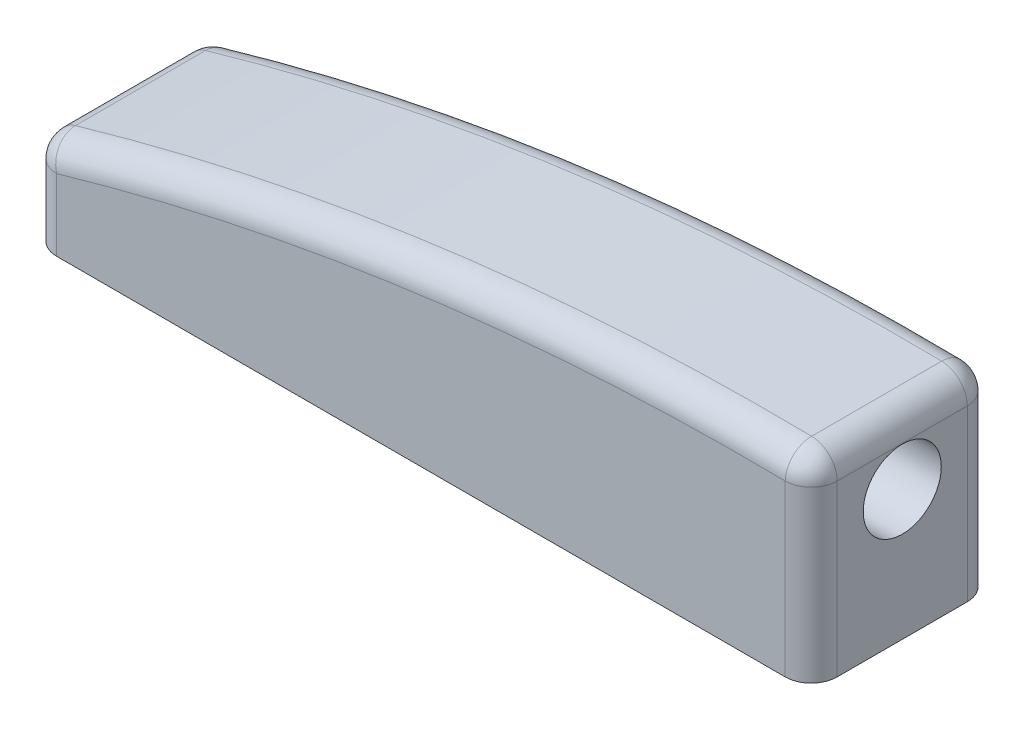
ISO-10303-21;
HEADER;
FILE_DESCRIPTION(('STEP AP214'),'2;1');
FILE_NAME('part.step','',(''),(''),'','','');
FILE_SCHEMA(('AUTOMOTIVE_DESIGN { 1 0 10303 214 1 1 1 1 }'));
ENDSEC;
DATA;
#1=APPLICATION_CONTEXT('core data for automotive mechanical design processes');
#2=APPLICATION_PROTOCOL_DEFINITION('international standard','automotive_design',2000,#1);
#3=PRODUCT_CONTEXT('',#1,'mechanical');
#4=PRODUCT('Part','Part','',(#3));
#5=PRODUCT_RELATED_PRODUCT_CATEGORY('part','',(#4));
#6=PRODUCT_DEFINITION_FORMATION('','',#4);
#7=PRODUCT_DEFINITION_CONTEXT('part definition',#1,'design');
#8=PRODUCT_DEFINITION('design','',#6,#7);
#9=PRODUCT_DEFINITION_SHAPE('','',#8);
#10=(LENGTH_UNIT() NAMED_UNIT(*) SI_UNIT(.MILLI.,.METRE.));
#11=(NAMED_UNIT(*) PLANE_ANGLE_UNIT() SI_UNIT($,.RADIAN.));
#12=(NAMED_UNIT(*) SI_UNIT($,.STERADIAN.) SOLID_ANGLE_UNIT());
#13=UNCERTAINTY_MEASURE_WITH_UNIT(LENGTH_MEASURE(1.E-05),#10,'distance_accuracy_value','');
#14=(GEOMETRIC_REPRESENTATION_CONTEXT(3) GLOBAL_UNCERTAINTY_ASSIGNED_CONTEXT((#13)) GLOBAL_UNIT_ASSIGNED_CONTEXT((#10,
#11,#12)) REPRESENTATION_CONTEXT('',''));
#15=CARTESIAN_POINT('',(0.,0.,0.));
#16=DIRECTION('',(0.,0.,1.));
#17=DIRECTION('',(1.,0.,0.));
#18=AXIS2_PLACEMENT_3D('',#15,#16,#17);
#19=CARTESIAN_POINT('',(-68.2676375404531,0.,35.));
#20=DIRECTION('',(0.,1.,0.));
#21=DIRECTION('',(0.,0.,1.));
#22=AXIS2_PLACEMENT_3D('',#19,#20,#21);
#23=PLANE('',#22);
#24=DIRECTION('',(0.,0.,-1.));
#25=VECTOR('',#24,1.);
#26=CARTESIAN_POINT('',(-68.2676375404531,0.,35.));
#27=LINE('',#26,#25);
#28=CARTESIAN_POINT('',(-68.2676375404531,0.,25.));
#29=VERTEX_POINT('',#28);
#30=CARTESIAN_POINT('',(-68.2676375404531,0.,-25.));
#31=VERTEX_POINT('',#30);
#32=EDGE_CURVE('E407',#29,#31,#27,.T.);
#33=ORIENTED_EDGE('',*,*,#32,.T.);
#34=CARTESIAN_POINT('',(-58.2676375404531,0.,-25.));
#35=DIRECTION('',(0.,1.,0.));
#36=DIRECTION('',(0.,0.,1.));
#37=AXIS2_PLACEMENT_3D('',#34,#35,#36);
#38=CIRCLE('',#37,10.);
#39=CARTESIAN_POINT('',(-58.2676375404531,0.,-35.));
#40=VERTEX_POINT('',#39);
#41=EDGE_CURVE('E441',#31,#40,#38,.F.);
#42=ORIENTED_EDGE('',*,*,#41,.T.);
#43=DIRECTION('',(1.,0.,0.));
#44=VECTOR('',#43,1.);
#45=CARTESIAN_POINT('',(-68.2676375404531,0.,-35.));
#46=LINE('',#45,#44);
#47=CARTESIAN_POINT('',(221.732362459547,0.,-35.));
#48=VERTEX_POINT('',#47);
#49=EDGE_CURVE('E396',#40,#48,#46,.T.);
#50=ORIENTED_EDGE('',*,*,#49,.T.);
#51=CARTESIAN_POINT('',(221.732362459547,0.,-25.));
#52=DIRECTION('',(0.,1.,0.));
#53=DIRECTION('',(0.,0.,1.));
#54=AXIS2_PLACEMENT_3D('',#51,#52,#53);
#55=CIRCLE('',#54,10.);
#56=CARTESIAN_POINT('',(231.732362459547,0.,-25.));
#57=VERTEX_POINT('',#56);
#58=EDGE_CURVE('E437',#48,#57,#55,.F.);
#59=ORIENTED_EDGE('',*,*,#58,.T.);
#60=DIRECTION('',(0.,0.,-1.));
#61=VECTOR('',#60,1.);
#62=CARTESIAN_POINT('',(231.732362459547,0.,35.));
#63=LINE('',#62,#61);
#64=CARTESIAN_POINT('',(231.732362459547,0.,25.));
#65=VERTEX_POINT('',#64);
#66=EDGE_CURVE('E403',#65,#57,#63,.T.);
#67=ORIENTED_EDGE('',*,*,#66,.F.);
#68=CARTESIAN_POINT('',(221.732362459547,0.,25.));
#69=DIRECTION('',(0.,1.,0.));
#70=DIRECTION('',(0.,0.,1.));
#71=AXIS2_PLACEMENT_3D('',#68,#69,#70);
#72=CIRCLE('',#71,10.);
#73=CARTESIAN_POINT('',(221.732362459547,0.,35.));
#74=VERTEX_POINT('',#73);
#75=EDGE_CURVE('E435',#65,#74,#72,.F.);
#76=ORIENTED_EDGE('',*,*,#75,.T.);
#77=DIRECTION('',(1.,0.,0.));
#78=VECTOR('',#77,1.);
#79=CARTESIAN_POINT('',(-68.2676375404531,0.,35.));
#80=LINE('',#79,#78);
#81=CARTESIAN_POINT('',(-58.2676375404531,0.,35.));
#82=VERTEX_POINT('',#81);
#83=EDGE_CURVE('E398',#82,#74,#80,.T.);
#84=ORIENTED_EDGE('',*,*,#83,.F.);
#85=CARTESIAN_POINT('',(-58.2676375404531,0.,25.));
#86=DIRECTION('',(0.,1.,0.));
#87=DIRECTION('',(0.,0.,1.));
#88=AXIS2_PLACEMENT_3D('',#85,#86,#87);
#89=CIRCLE('',#88,10.);
#90=EDGE_CURVE('E439',#82,#29,#89,.F.);
#91=ORIENTED_EDGE('',*,*,#90,.T.);
#92=EDGE_LOOP('',(#33,#42,#50,#59,#67,#76,#84,#91));
#93=FACE_BOUND('',#92,.T.);
#94=DIRECTION('',(0.,0.,-1.));
#95=VECTOR('',#94,1.);
#96=CARTESIAN_POINT('',(-63.2676375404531,0.,35.));
#97=LINE('',#96,#95);
#98=CARTESIAN_POINT('',(-63.2676375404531,0.,25.));
#99=VERTEX_POINT('',#98);
#100=CARTESIAN_POINT('',(-63.2676375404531,0.,-25.));
#101=VERTEX_POINT('',#100);
#102=EDGE_CURVE('E206',#99,#101,#97,.T.);
#103=ORIENTED_EDGE('',*,*,#102,.F.);
#104=CARTESIAN_POINT('',(-58.2676375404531,0.,25.));
#105=DIRECTION('',(0.,1.,0.));
#106=DIRECTION('',(0.,0.,1.));
#107=AXIS2_PLACEMENT_3D('',#104,#105,#106);
#108=CIRCLE('',#107,5.);
#109=CARTESIAN_POINT('',(-58.2676375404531,0.,30.));
#110=VERTEX_POINT('',#109);
#111=EDGE_CURVE('E252',#110,#99,#108,.F.);
#112=ORIENTED_EDGE('',*,*,#111,.F.);
#113=DIRECTION('',(1.,0.,0.));
#114=VECTOR('',#113,1.);
#115=CARTESIAN_POINT('',(206.718845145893,0.,30.));
#116=LINE('',#115,#114);
#117=CARTESIAN_POINT('',(221.732362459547,0.,30.));
#118=VERTEX_POINT('',#117);
#119=EDGE_CURVE('E60',#110,#118,#116,.T.);
#120=ORIENTED_EDGE('',*,*,#119,.T.);
#121=CARTESIAN_POINT('',(221.732362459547,0.,25.));
#122=DIRECTION('',(0.,1.,0.));
#123=DIRECTION('',(0.,0.,1.));
#124=AXIS2_PLACEMENT_3D('',#121,#122,#123);
#125=CIRCLE('',#124,5.);
#126=CARTESIAN_POINT('',(226.732362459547,0.,25.));
#127=VERTEX_POINT('',#126);
#128=EDGE_CURVE('E210',#127,#118,#125,.F.);
#129=ORIENTED_EDGE('',*,*,#128,.F.);
#130=DIRECTION('',(0.,0.,-1.));
#131=VECTOR('',#130,1.);
#132=CARTESIAN_POINT('',(226.732362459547,0.,35.));
#133=LINE('',#132,#131);
#134=CARTESIAN_POINT('',(226.732362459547,0.,-25.));
#135=VERTEX_POINT('',#134);
#136=EDGE_CURVE('E248',#127,#135,#133,.T.);
#137=ORIENTED_EDGE('',*,*,#136,.T.);
#138=CARTESIAN_POINT('',(221.732362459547,0.,-25.));
#139=DIRECTION('',(0.,1.,0.));
#140=DIRECTION('',(0.,0.,1.));
#141=AXIS2_PLACEMENT_3D('',#138,#139,#140);
#142=CIRCLE('',#141,5.);
#143=CARTESIAN_POINT('',(221.732362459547,0.,-30.));
#144=VERTEX_POINT('',#143);
#145=EDGE_CURVE('E257',#144,#135,#142,.F.);
#146=ORIENTED_EDGE('',*,*,#145,.F.);
#147=DIRECTION('',(1.,0.,0.));
#148=VECTOR('',#147,1.);
#149=CARTESIAN_POINT('',(206.718845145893,0.,-30.));
#150=LINE('',#149,#148);
#151=CARTESIAN_POINT('',(-58.2676375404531,0.,-30.));
#152=VERTEX_POINT('',#151);
#153=EDGE_CURVE('E253',#152,#144,#150,.T.);
#154=ORIENTED_EDGE('',*,*,#153,.F.);
#155=CARTESIAN_POINT('',(-58.2676375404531,0.,-25.));
#156=DIRECTION('',(0.,1.,0.));
#157=DIRECTION('',(0.,0.,1.));
#158=AXIS2_PLACEMENT_3D('',#155,#156,#157);
#159=CIRCLE('',#158,5.);
#160=EDGE_CURVE('E249',#101,#152,#159,.F.);
#161=ORIENTED_EDGE('',*,*,#160,.F.);
#162=EDGE_LOOP('',(#103,#112,#120,#129,#137,#146,#154,#161));
#163=FACE_BOUND('',#162,.T.);
#164=ADVANCED_FACE('F43',(#93,#163),#23,.F.);
#165=CARTESIAN_POINT('',(-68.2676375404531,0.,35.));
#166=DIRECTION('',(1.,0.,0.));
#167=DIRECTION('',(0.,0.,-1.));
#168=AXIS2_PLACEMENT_3D('',#165,#166,#167);
#169=PLANE('',#168);
#170=DIRECTION('',(0.,0.,-1.));
#171=VECTOR('',#170,1.);
#172=CARTESIAN_POINT('',(-68.2676375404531,27.5274490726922,35.));
#173=LINE('',#172,#171);
#174=CARTESIAN_POINT('',(-68.2676375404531,27.5274490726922,25.));
#175=VERTEX_POINT('',#174);
#176=CARTESIAN_POINT('',(-68.2676375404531,27.5274490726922,-25.));
#177=VERTEX_POINT('',#176);
#178=EDGE_CURVE('E431',#175,#177,#173,.T.);
#179=ORIENTED_EDGE('',*,*,#178,.T.);
#180=DIRECTION('',(0.,-1.,0.));
#181=VECTOR('',#180,1.);
#182=CARTESIAN_POINT('',(-68.2676375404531,0.,-25.));
#183=LINE('',#182,#181);
#184=EDGE_CURVE('E433',#177,#31,#183,.T.);
#185=ORIENTED_EDGE('',*,*,#184,.T.);
#186=ORIENTED_EDGE('',*,*,#32,.F.);
#187=DIRECTION('',(0.,-1.,0.));
#188=VECTOR('',#187,1.);
#189=CARTESIAN_POINT('',(-68.2676375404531,0.,25.));
#190=LINE('',#189,#188);
#191=EDGE_CURVE('E429',#29,#175,#190,.F.);
#192=ORIENTED_EDGE('',*,*,#191,.T.);
#193=EDGE_LOOP('',(#179,#185,#186,#192));
#194=FACE_BOUND('',#193,.T.);
#195=ADVANCED_FACE('F306',(#194),#169,.F.);
#196=CARTESIAN_POINT('',(231.732362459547,0.,35.));
#197=DIRECTION('',(-1.,0.,0.));
#198=DIRECTION('',(0.,0.,1.));
#199=AXIS2_PLACEMENT_3D('',#196,#197,#198);
#200=PLANE('',#199);
#201=CARTESIAN_POINT('',(231.732362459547,50.,0.));
#202=DIRECTION('',(1.,0.,0.));
#203=DIRECTION('',(0.,0.,-1.));
#204=AXIS2_PLACEMENT_3D('',#201,#202,#203);
#205=CIRCLE('',#204,15.);
#206=CARTESIAN_POINT('',(231.732362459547,50.,-15.));
#207=VERTEX_POINT('',#206);
#208=EDGE_CURVE('E271',#207,#207,#205,.T.);
#209=ORIENTED_EDGE('',*,*,#208,.F.);
#210=EDGE_LOOP('',(#209));
#211=FACE_BOUND('',#210,.T.);
#212=ORIENTED_EDGE('',*,*,#66,.T.);
#213=DIRECTION('',(0.,1.,0.));
#214=VECTOR('',#213,1.);
#215=CARTESIAN_POINT('',(231.732362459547,75.,-25.));
#216=LINE('',#215,#214);
#217=CARTESIAN_POINT('',(231.732362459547,65.2077758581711,-25.));
#218=VERTEX_POINT('',#217);
#219=EDGE_CURVE('E12',#57,#218,#216,.T.);
#220=ORIENTED_EDGE('',*,*,#219,.T.);
#221=DIRECTION('',(0.,0.,-1.));
#222=VECTOR('',#221,1.);
#223=CARTESIAN_POINT('',(231.732362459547,65.2077758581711,35.));
#224=LINE('',#223,#222);
#225=CARTESIAN_POINT('',(231.732362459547,65.2077758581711,25.));
#226=VERTEX_POINT('',#225);
#227=EDGE_CURVE('E52',#218,#226,#224,.F.);
#228=ORIENTED_EDGE('',*,*,#227,.T.);
#229=DIRECTION('',(0.,1.,0.));
#230=VECTOR('',#229,1.);
#231=CARTESIAN_POINT('',(231.732362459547,0.,25.));
#232=LINE('',#231,#230);
#233=EDGE_CURVE('E448',#226,#65,#232,.F.);
#234=ORIENTED_EDGE('',*,*,#233,.T.);
#235=EDGE_LOOP('',(#212,#220,#228,#234));
#236=FACE_BOUND('',#235,.T.);
#237=ADVANCED_FACE('F312',(#211,#236),#200,.F.);
#238=CARTESIAN_POINT('',(206.718845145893,-882.398620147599,35.));
#239=DIRECTION('',(0.,0.,-1.));
#240=DIRECTION('',(-1.,0.,0.));
#241=AXIS2_PLACEMENT_3D('',#238,#239,#240);
#242=CYLINDRICAL_SURFACE('',#241,957.725322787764);
#243=DIRECTION('',(0.,0.,-1.));
#244=VECTOR('',#243,1.);
#245=CARTESIAN_POINT('',(221.890778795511,75.2065209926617,35.));
#246=LINE('',#245,#244);
#247=CARTESIAN_POINT('',(221.890778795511,75.2065209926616,25.));
#248=VERTEX_POINT('',#247);
#249=CARTESIAN_POINT('',(221.890778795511,75.2065209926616,-25.));
#250=VERTEX_POINT('',#249);
#251=EDGE_CURVE('E414',#248,#250,#246,.T.);
#252=ORIENTED_EDGE('',*,*,#251,.T.);
#253=CARTESIAN_POINT('',(206.718845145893,-882.398620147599,-25.));
#254=DIRECTION('',(0.,0.,-1.));
#255=DIRECTION('',(-1.,0.,0.));
#256=AXIS2_PLACEMENT_3D('',#253,#254,#255);
#257=CIRCLE('',#256,957.725322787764);
#258=CARTESIAN_POINT('',(-61.0636637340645,37.1286072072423,-25.));
#259=VERTEX_POINT('',#258);
#260=EDGE_CURVE('E419',#250,#259,#257,.F.);
#261=ORIENTED_EDGE('',*,*,#260,.T.);
#262=DIRECTION('',(0.,0.,-1.));
#263=VECTOR('',#262,1.);
#264=CARTESIAN_POINT('',(-61.0636637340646,37.1286072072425,35.));
#265=LINE('',#264,#263);
#266=CARTESIAN_POINT('',(-61.0636637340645,37.1286072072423,25.));
#267=VERTEX_POINT('',#266);
#268=EDGE_CURVE('E417',#259,#267,#265,.F.);
#269=ORIENTED_EDGE('',*,*,#268,.T.);
#270=CARTESIAN_POINT('',(206.718845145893,-882.398620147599,25.));
#271=DIRECTION('',(0.,0.,-1.));
#272=DIRECTION('',(-1.,0.,0.));
#273=AXIS2_PLACEMENT_3D('',#270,#271,#272);
#274=CIRCLE('',#273,957.725322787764);
#275=EDGE_CURVE('E377',#267,#248,#274,.T.);
#276=ORIENTED_EDGE('',*,*,#275,.T.);
#277=EDGE_LOOP('',(#252,#261,#269,#276));
#278=FACE_BOUND('',#277,.T.);
#279=ADVANCED_FACE('F486',(#278),#242,.T.);
#280=CARTESIAN_POINT('',(206.718845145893,-882.398620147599,35.));
#281=DIRECTION('',(0.,0.,-1.));
#282=DIRECTION('',(-1.,0.,0.));
#283=AXIS2_PLACEMENT_3D('',#280,#281,#282);
#284=PLANE('',#283);
#285=CARTESIAN_POINT('',(206.718845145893,-882.398620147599,35.));
#286=DIRECTION('',(0.,0.,-1.));
#287=DIRECTION('',(-1.,0.,0.));
#288=AXIS2_PLACEMENT_3D('',#285,#286,#287);
#289=CIRCLE('',#288,947.725322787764);
#290=CARTESIAN_POINT('',(221.732362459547,65.207775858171,35.));
#291=VERTEX_POINT('',#290);
#292=CARTESIAN_POINT('',(-58.2676375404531,27.5274490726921,35.));
#293=VERTEX_POINT('',#292);
#294=EDGE_CURVE('E375',#291,#293,#289,.F.);
#295=ORIENTED_EDGE('',*,*,#294,.T.);
#296=DIRECTION('',(0.,-1.,0.));
#297=VECTOR('',#296,1.);
#298=CARTESIAN_POINT('',(-58.2676375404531,-882.398620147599,35.));
#299=LINE('',#298,#297);
#300=EDGE_CURVE('E446',#293,#82,#299,.T.);
#301=ORIENTED_EDGE('',*,*,#300,.T.);
#302=ORIENTED_EDGE('',*,*,#83,.T.);
#303=DIRECTION('',(0.,1.,0.));
#304=VECTOR('',#303,1.);
#305=CARTESIAN_POINT('',(221.732362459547,-882.398620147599,35.));
#306=LINE('',#305,#304);
#307=EDGE_CURVE('E443',#74,#291,#306,.T.);
#308=ORIENTED_EDGE('',*,*,#307,.T.);
#309=EDGE_LOOP('',(#295,#301,#302,#308));
#310=FACE_BOUND('',#309,.T.);
#311=ADVANCED_FACE('F484',(#310),#284,.F.);
#312=CARTESIAN_POINT('',(206.718845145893,-882.398620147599,-35.));
#313=DIRECTION('',(0.,0.,-1.));
#314=DIRECTION('',(-1.,0.,0.));
#315=AXIS2_PLACEMENT_3D('',#312,#313,#314);
#316=PLANE('',#315);
#317=ORIENTED_EDGE('',*,*,#49,.F.);
#318=DIRECTION('',(0.,-1.,0.));
#319=VECTOR('',#318,1.);
#320=CARTESIAN_POINT('',(-58.2676375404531,34.9999999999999,-35.));
#321=LINE('',#320,#319);
#322=CARTESIAN_POINT('',(-58.2676375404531,27.5274490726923,-35.));
#323=VERTEX_POINT('',#322);
#324=EDGE_CURVE('E427',#40,#323,#321,.F.);
#325=ORIENTED_EDGE('',*,*,#324,.T.);
#326=CARTESIAN_POINT('',(206.718845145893,-882.398620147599,-35.));
#327=DIRECTION('',(0.,0.,-1.));
#328=DIRECTION('',(-1.,0.,0.));
#329=AXIS2_PLACEMENT_3D('',#326,#327,#328);
#330=CIRCLE('',#329,947.725322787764);
#331=CARTESIAN_POINT('',(221.732362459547,65.207775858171,-35.));
#332=VERTEX_POINT('',#331);
#333=EDGE_CURVE('E424',#323,#332,#330,.T.);
#334=ORIENTED_EDGE('',*,*,#333,.T.);
#335=DIRECTION('',(0.,1.,0.));
#336=VECTOR('',#335,1.);
#337=CARTESIAN_POINT('',(221.732362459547,0.,-35.));
#338=LINE('',#337,#336);
#339=EDGE_CURVE('E422',#332,#48,#338,.F.);
#340=ORIENTED_EDGE('',*,*,#339,.T.);
#341=EDGE_LOOP('',(#317,#325,#334,#340));
#342=FACE_BOUND('',#341,.T.);
#343=ADVANCED_FACE('F366',(#342),#316,.T.);
#344=CARTESIAN_POINT('',(221.732362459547,-882.398620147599,25.));
#345=DIRECTION('',(0.,1.,0.));
#346=DIRECTION('',(0.,0.,1.));
#347=AXIS2_PLACEMENT_3D('',#344,#345,#346);
#348=CYLINDRICAL_SURFACE('',#347,10.);
#349=ORIENTED_EDGE('',*,*,#75,.F.);
#350=ORIENTED_EDGE('',*,*,#233,.F.);
#351=CARTESIAN_POINT('',(221.732362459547,65.207775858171,25.));
#352=DIRECTION('',(0.,1.,0.));
#353=DIRECTION('',(-1.,0.,0.));
#354=AXIS2_PLACEMENT_3D('',#351,#352,#353);
#355=CIRCLE('',#354,10.);
#356=EDGE_CURVE('E47',#291,#226,#355,.T.);
#357=ORIENTED_EDGE('',*,*,#356,.F.);
#358=ORIENTED_EDGE('',*,*,#307,.F.);
#359=EDGE_LOOP('',(#349,#350,#357,#358));
#360=FACE_BOUND('',#359,.T.);
#361=ADVANCED_FACE('F45',(#360),#348,.T.);
#362=CARTESIAN_POINT('',(206.718845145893,-882.398620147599,25.));
#363=DIRECTION('',(0.,0.,-1.));
#364=DIRECTION('',(-1.,0.,0.));
#365=AXIS2_PLACEMENT_3D('',#362,#363,#364);
#366=TOROIDAL_SURFACE('',#365,947.725322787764,10.);
#367=CARTESIAN_POINT('',(-58.2676375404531,27.5274490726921,25.));
#368=DIRECTION('',(-0.960115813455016,-0.279602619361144,0.));
#369=DIRECTION('',(0.279602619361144,-0.960115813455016,0.));
#370=AXIS2_PLACEMENT_3D('',#367,#368,#369);
#371=CIRCLE('',#370,10.);
#372=EDGE_CURVE('E372',#293,#267,#371,.T.);
#373=ORIENTED_EDGE('',*,*,#372,.F.);
#374=ORIENTED_EDGE('',*,*,#294,.F.);
#375=CARTESIAN_POINT('',(221.732362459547,65.207775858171,25.));
#376=DIRECTION('',(0.999874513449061,-0.0158416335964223,0.));
#377=DIRECTION('',(0.0158416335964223,0.999874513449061,0.));
#378=AXIS2_PLACEMENT_3D('',#375,#376,#377);
#379=CIRCLE('',#378,10.);
#380=EDGE_CURVE('E380',#248,#291,#379,.T.);
#381=ORIENTED_EDGE('',*,*,#380,.F.);
#382=ORIENTED_EDGE('',*,*,#275,.F.);
#383=EDGE_LOOP('',(#373,#374,#381,#382));
#384=FACE_BOUND('',#383,.T.);
#385=ADVANCED_FACE('F359',(#384),#366,.T.);
#386=CARTESIAN_POINT('',(-58.2676375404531,-882.398620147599,25.));
#387=DIRECTION('',(0.,-1.,0.));
#388=DIRECTION('',(0.,0.,-1.));
#389=AXIS2_PLACEMENT_3D('',#386,#387,#388);
#390=CYLINDRICAL_SURFACE('',#389,10.);
#391=ORIENTED_EDGE('',*,*,#90,.F.);
#392=ORIENTED_EDGE('',*,*,#300,.F.);
#393=CARTESIAN_POINT('',(-58.2676375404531,27.5274490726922,25.));
#394=DIRECTION('',(0.,1.,0.));
#395=DIRECTION('',(0.,0.,1.));
#396=AXIS2_PLACEMENT_3D('',#393,#394,#395);
#397=CIRCLE('',#396,10.);
#398=EDGE_CURVE('E381',#175,#293,#397,.T.);
#399=ORIENTED_EDGE('',*,*,#398,.F.);
#400=ORIENTED_EDGE('',*,*,#191,.F.);
#401=EDGE_LOOP('',(#391,#392,#399,#400));
#402=FACE_BOUND('',#401,.T.);
#403=ADVANCED_FACE('F356',(#402),#390,.T.);
#404=CARTESIAN_POINT('',(221.732362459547,65.2077758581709,25.));
#405=DIRECTION('',(0.,0.,1.));
#406=DIRECTION('',(1.,0.,0.));
#407=AXIS2_PLACEMENT_3D('',#404,#405,#406);
#408=SPHERICAL_SURFACE('',#407,10.);
#409=ORIENTED_EDGE('',*,*,#380,.T.);
#410=ORIENTED_EDGE('',*,*,#356,.T.);
#411=CARTESIAN_POINT('',(221.732362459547,65.2077758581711,25.));
#412=DIRECTION('',(0.,0.,1.));
#413=DIRECTION('',(1.,0.,0.));
#414=AXIS2_PLACEMENT_3D('',#411,#412,#413);
#415=CIRCLE('',#414,10.);
#416=EDGE_CURVE('E388',#248,#226,#415,.F.);
#417=ORIENTED_EDGE('',*,*,#416,.F.);
#418=EDGE_LOOP('',(#409,#410,#417));
#419=FACE_BOUND('',#418,.T.);
#420=ADVANCED_FACE('F352',(#419),#408,.T.);
#421=CARTESIAN_POINT('',(-58.2676375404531,27.5274490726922,25.));
#422=DIRECTION('',(0.,0.,1.));
#423=DIRECTION('',(1.,0.,0.));
#424=AXIS2_PLACEMENT_3D('',#421,#422,#423);
#425=SPHERICAL_SURFACE('',#424,10.);
#426=ORIENTED_EDGE('',*,*,#398,.T.);
#427=ORIENTED_EDGE('',*,*,#372,.T.);
#428=CARTESIAN_POINT('',(-58.2676375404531,27.5274490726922,25.));
#429=DIRECTION('',(0.,0.,1.));
#430=DIRECTION('',(1.,0.,0.));
#431=AXIS2_PLACEMENT_3D('',#428,#429,#430);
#432=CIRCLE('',#431,10.);
#433=EDGE_CURVE('E384',#175,#267,#432,.F.);
#434=ORIENTED_EDGE('',*,*,#433,.F.);
#435=EDGE_LOOP('',(#426,#427,#434));
#436=FACE_BOUND('',#435,.T.);
#437=ADVANCED_FACE('F348',(#436),#425,.T.);
#438=CARTESIAN_POINT('',(221.732362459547,0.,-25.));
#439=DIRECTION('',(0.,-1.,0.));
#440=DIRECTION('',(0.,0.,-1.));
#441=AXIS2_PLACEMENT_3D('',#438,#439,#440);
#442=CYLINDRICAL_SURFACE('',#441,10.);
#443=ORIENTED_EDGE('',*,*,#58,.F.);
#444=ORIENTED_EDGE('',*,*,#339,.F.);
#445=CARTESIAN_POINT('',(221.732362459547,65.2077758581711,-25.));
#446=DIRECTION('',(0.,1.,0.));
#447=DIRECTION('',(0.,0.,1.));
#448=AXIS2_PLACEMENT_3D('',#445,#446,#447);
#449=CIRCLE('',#448,10.);
#450=EDGE_CURVE('E464',#218,#332,#449,.T.);
#451=ORIENTED_EDGE('',*,*,#450,.F.);
#452=ORIENTED_EDGE('',*,*,#219,.F.);
#453=EDGE_LOOP('',(#443,#444,#451,#452));
#454=FACE_BOUND('',#453,.T.);
#455=ADVANCED_FACE('F344',(#454),#442,.T.);
#456=CARTESIAN_POINT('',(221.732362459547,65.2077758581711,35.));
#457=DIRECTION('',(0.,0.,-1.));
#458=DIRECTION('',(-1.,0.,0.));
#459=AXIS2_PLACEMENT_3D('',#456,#457,#458);
#460=CYLINDRICAL_SURFACE('',#459,10.);
#461=ORIENTED_EDGE('',*,*,#416,.T.);
#462=ORIENTED_EDGE('',*,*,#227,.F.);
#463=CARTESIAN_POINT('',(221.732362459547,65.207775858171,-25.));
#464=DIRECTION('',(0.,0.,-1.));
#465=DIRECTION('',(-1.,0.,0.));
#466=AXIS2_PLACEMENT_3D('',#463,#464,#465);
#467=CIRCLE('',#466,10.);
#468=EDGE_CURVE('E461',#250,#218,#467,.T.);
#469=ORIENTED_EDGE('',*,*,#468,.F.);
#470=ORIENTED_EDGE('',*,*,#251,.F.);
#471=EDGE_LOOP('',(#461,#462,#469,#470));
#472=FACE_BOUND('',#471,.T.);
#473=ADVANCED_FACE('F340',(#472),#460,.T.);
#474=CARTESIAN_POINT('',(-58.2676375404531,27.5274490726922,35.));
#475=DIRECTION('',(0.,0.,-1.));
#476=DIRECTION('',(-1.,0.,0.));
#477=AXIS2_PLACEMENT_3D('',#474,#475,#476);
#478=CYLINDRICAL_SURFACE('',#477,10.);
#479=ORIENTED_EDGE('',*,*,#433,.T.);
#480=ORIENTED_EDGE('',*,*,#268,.F.);
#481=CARTESIAN_POINT('',(-58.2676375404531,27.5274490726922,-25.));
#482=DIRECTION('',(0.,0.,-1.));
#483=DIRECTION('',(-1.,0.,0.));
#484=AXIS2_PLACEMENT_3D('',#481,#482,#483);
#485=CIRCLE('',#484,10.);
#486=EDGE_CURVE('E458',#177,#259,#485,.T.);
#487=ORIENTED_EDGE('',*,*,#486,.F.);
#488=ORIENTED_EDGE('',*,*,#178,.F.);
#489=EDGE_LOOP('',(#479,#480,#487,#488));
#490=FACE_BOUND('',#489,.T.);
#491=ADVANCED_FACE('F336',(#490),#478,.T.);
#492=CARTESIAN_POINT('',(-58.2676375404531,0.,-25.));
#493=DIRECTION('',(0.,1.,0.));
#494=DIRECTION('',(0.,0.,1.));
#495=AXIS2_PLACEMENT_3D('',#492,#493,#494);
#496=CYLINDRICAL_SURFACE('',#495,10.);
#497=ORIENTED_EDGE('',*,*,#41,.F.);
#498=ORIENTED_EDGE('',*,*,#184,.F.);
#499=CARTESIAN_POINT('',(-58.2676375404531,27.5274490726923,-25.));
#500=DIRECTION('',(0.,1.,0.));
#501=DIRECTION('',(-1.,0.,0.));
#502=AXIS2_PLACEMENT_3D('',#499,#500,#501);
#503=CIRCLE('',#502,10.);
#504=EDGE_CURVE('E455',#323,#177,#503,.T.);
#505=ORIENTED_EDGE('',*,*,#504,.F.);
#506=ORIENTED_EDGE('',*,*,#324,.F.);
#507=EDGE_LOOP('',(#497,#498,#505,#506));
#508=FACE_BOUND('',#507,.T.);
#509=ADVANCED_FACE('F332',(#508),#496,.T.);
#510=CARTESIAN_POINT('',(221.732362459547,65.2077758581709,-25.));
#511=DIRECTION('',(0.,0.,1.));
#512=DIRECTION('',(1.,0.,0.));
#513=AXIS2_PLACEMENT_3D('',#510,#511,#512);
#514=SPHERICAL_SURFACE('',#513,10.);
#515=ORIENTED_EDGE('',*,*,#468,.T.);
#516=ORIENTED_EDGE('',*,*,#450,.T.);
#517=CARTESIAN_POINT('',(221.732362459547,65.207775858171,-25.));
#518=DIRECTION('',(0.999874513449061,-0.0158416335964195,0.));
#519=DIRECTION('',(0.0158416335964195,0.999874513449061,0.));
#520=AXIS2_PLACEMENT_3D('',#517,#518,#519);
#521=CIRCLE('',#520,10.);
#522=EDGE_CURVE('E453',#250,#332,#521,.F.);
#523=ORIENTED_EDGE('',*,*,#522,.F.);
#524=EDGE_LOOP('',(#515,#516,#523));
#525=FACE_BOUND('',#524,.T.);
#526=ADVANCED_FACE('F328',(#525),#514,.T.);
#527=CARTESIAN_POINT('',(-58.2676375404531,27.5274490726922,-25.));
#528=DIRECTION('',(0.,0.,1.));
#529=DIRECTION('',(1.,0.,0.));
#530=AXIS2_PLACEMENT_3D('',#527,#528,#529);
#531=SPHERICAL_SURFACE('',#530,10.);
#532=ORIENTED_EDGE('',*,*,#504,.T.);
#533=ORIENTED_EDGE('',*,*,#486,.T.);
#534=CARTESIAN_POINT('',(-58.2676375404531,27.5274490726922,-25.));
#535=DIRECTION('',(-0.960115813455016,-0.279602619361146,0.));
#536=DIRECTION('',(0.279602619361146,-0.960115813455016,0.));
#537=AXIS2_PLACEMENT_3D('',#534,#535,#536);
#538=CIRCLE('',#537,10.);
#539=EDGE_CURVE('E451',#323,#259,#538,.F.);
#540=ORIENTED_EDGE('',*,*,#539,.F.);
#541=EDGE_LOOP('',(#532,#533,#540));
#542=FACE_BOUND('',#541,.T.);
#543=ADVANCED_FACE('F324',(#542),#531,.T.);
#544=CARTESIAN_POINT('',(206.718845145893,-882.398620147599,-25.));
#545=DIRECTION('',(0.,0.,-1.));
#546=DIRECTION('',(-1.,0.,0.));
#547=AXIS2_PLACEMENT_3D('',#544,#545,#546);
#548=TOROIDAL_SURFACE('',#547,947.725322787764,10.);
#549=ORIENTED_EDGE('',*,*,#522,.T.);
#550=ORIENTED_EDGE('',*,*,#333,.F.);
#551=ORIENTED_EDGE('',*,*,#539,.T.);
#552=ORIENTED_EDGE('',*,*,#260,.F.);
#553=EDGE_LOOP('',(#549,#550,#551,#552));
#554=FACE_BOUND('',#553,.T.);
#555=ADVANCED_FACE('F320',(#554),#548,.T.);
#556=CARTESIAN_POINT('',(131.732362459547,50.,0.));
#557=DIRECTION('',(1.,0.,0.));
#558=DIRECTION('',(0.,0.,-1.));
#559=AXIS2_PLACEMENT_3D('',#556,#557,#558);
#560=CYLINDRICAL_SURFACE('',#559,15.);
#561=CARTESIAN_POINT('',(131.732362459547,50.,0.));
#562=DIRECTION('',(1.,0.,0.));
#563=DIRECTION('',(0.,0.,-1.));
#564=AXIS2_PLACEMENT_3D('',#561,#562,#563);
#565=CIRCLE('',#564,15.);
#566=CARTESIAN_POINT('',(131.732362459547,50.,-15.));
#567=VERTEX_POINT('',#566);
#568=EDGE_CURVE('E273',#567,#567,#565,.T.);
#569=CARTESIAN_POINT('',(131.732362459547,50.,-15.));
#570=CARTESIAN_POINT('',(132.774029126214,50.,-15.));
#571=CARTESIAN_POINT('',(133.81569579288,50.,-15.));
#572=CARTESIAN_POINT('',(135.899029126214,50.,-15.));
#573=CARTESIAN_POINT('',(136.94069579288,50.,-15.));
#574=CARTESIAN_POINT('',(139.024029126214,50.,-15.));
#575=CARTESIAN_POINT('',(140.06569579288,50.,-15.));
#576=CARTESIAN_POINT('',(142.149029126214,50.,-15.));
#577=CARTESIAN_POINT('',(143.19069579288,50.,-15.));
#578=CARTESIAN_POINT('',(145.274029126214,50.,-15.));
#579=CARTESIAN_POINT('',(146.31569579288,50.,-15.));
#580=CARTESIAN_POINT('',(148.399029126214,50.,-15.));
#581=CARTESIAN_POINT('',(149.44069579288,50.,-15.));
#582=CARTESIAN_POINT('',(151.524029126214,50.,-15.));
#583=CARTESIAN_POINT('',(152.56569579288,50.,-15.));
#584=CARTESIAN_POINT('',(154.649029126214,50.,-15.));
#585=CARTESIAN_POINT('',(155.69069579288,50.,-15.));
#586=CARTESIAN_POINT('',(157.774029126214,50.,-15.));
#587=CARTESIAN_POINT('',(158.81569579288,50.,-15.));
#588=CARTESIAN_POINT('',(160.899029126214,50.,-15.));
#589=CARTESIAN_POINT('',(161.94069579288,50.,-15.));
#590=CARTESIAN_POINT('',(164.024029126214,50.,-15.));
#591=CARTESIAN_POINT('',(165.06569579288,50.,-15.));
#592=CARTESIAN_POINT('',(167.149029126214,50.,-15.));
#593=CARTESIAN_POINT('',(168.19069579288,50.,-15.));
#594=CARTESIAN_POINT('',(170.274029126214,50.,-15.));
#595=CARTESIAN_POINT('',(171.31569579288,50.,-15.));
#596=CARTESIAN_POINT('',(173.399029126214,50.,-15.));
#597=CARTESIAN_POINT('',(174.44069579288,50.,-15.));
#598=CARTESIAN_POINT('',(176.524029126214,50.,-15.));
#599=CARTESIAN_POINT('',(177.56569579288,50.,-15.));
#600=CARTESIAN_POINT('',(179.649029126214,50.,-15.));
#601=CARTESIAN_POINT('',(180.69069579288,50.,-15.));
#602=CARTESIAN_POINT('',(182.774029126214,50.,-15.));
#603=CARTESIAN_POINT('',(183.81569579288,50.,-15.));
#604=CARTESIAN_POINT('',(185.899029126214,50.,-15.));
#605=CARTESIAN_POINT('',(186.94069579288,50.,-15.));
#606=CARTESIAN_POINT('',(189.024029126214,50.,-15.));
#607=CARTESIAN_POINT('',(190.06569579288,50.,-15.));
#608=CARTESIAN_POINT('',(192.149029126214,50.,-15.));
#609=CARTESIAN_POINT('',(193.19069579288,50.,-15.));
#610=CARTESIAN_POINT('',(195.274029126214,50.,-15.));
#611=CARTESIAN_POINT('',(196.31569579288,50.,-15.));
#612=CARTESIAN_POINT('',(198.399029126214,50.,-15.));
#613=CARTESIAN_POINT('',(199.44069579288,50.,-15.));
#614=CARTESIAN_POINT('',(201.524029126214,50.,-15.));
#615=CARTESIAN_POINT('',(202.56569579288,50.,-15.));
#616=CARTESIAN_POINT('',(204.649029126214,50.,-15.));
#617=CARTESIAN_POINT('',(205.69069579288,50.,-15.));
#618=CARTESIAN_POINT('',(207.774029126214,50.,-15.));
#619=CARTESIAN_POINT('',(208.81569579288,50.,-15.));
#620=CARTESIAN_POINT('',(210.899029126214,50.,-15.));
#621=CARTESIAN_POINT('',(211.94069579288,50.,-15.));
#622=CARTESIAN_POINT('',(214.024029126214,50.,-15.));
#623=CARTESIAN_POINT('',(215.06569579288,50.,-15.));
#624=CARTESIAN_POINT('',(217.149029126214,50.,-15.));
#625=CARTESIAN_POINT('',(218.19069579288,50.,-15.));
#626=CARTESIAN_POINT('',(220.274029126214,50.,-15.));
#627=CARTESIAN_POINT('',(221.31569579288,50.,-15.));
#628=CARTESIAN_POINT('',(223.399029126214,50.,-15.));
#629=CARTESIAN_POINT('',(224.44069579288,50.,-15.));
#630=CARTESIAN_POINT('',(226.524029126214,50.,-15.));
#631=CARTESIAN_POINT('',(227.56569579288,50.,-15.));
#632=CARTESIAN_POINT('',(229.649029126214,50.,-15.));
#633=CARTESIAN_POINT('',(230.69069579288,50.,-15.));
#634=CARTESIAN_POINT('',(231.732362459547,50.,-15.));
#635=B_SPLINE_CURVE_WITH_KNOTS('',3,(#569,#570,#571,#572,#573,#574,#575,#576,#577,#578,#579,
#580,#581,#582,#583,#584,#585,#586,#587,#588,#589,#590,#591,#592,#593,#594,#595,#596,#597,#598,
#599,#600,#601,#602,#603,#604,#605,#606,#607,#608,#609,#610,#611,#612,#613,#614,#615,#616,#617,
#618,#619,#620,#621,#622,#623,#624,#625,#626,#627,#628,#629,#630,#631,#632,#633,#634),
.UNSPECIFIED.,.F.,.F.,(4,2,2,2,2,2,2,2,2,2,2,2,2,2,2,2,2,2,2,2,2,2,2,2,2,2,2,2,2,2,2,2,4),(0.,
3.12499999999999,6.24999999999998,9.37499999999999,12.5,15.625,18.75,21.875,25.,28.125,31.25,
34.375,37.5,40.625,43.75,46.875,50.,53.125,56.25,59.375,62.5,65.625,68.75,71.875,75.,78.125,
81.25,84.375,87.5,90.625,93.7499999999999,96.875,100.),.UNSPECIFIED.);
#636=EDGE_CURVE('BSEAM323',#567,#207,#635,.T.);
#637=ORIENTED_EDGE('',*,*,#568,.F.);
#638=ORIENTED_EDGE('',*,*,#208,.T.);
#639=ORIENTED_EDGE('',*,*,#636,.T.);
#640=ORIENTED_EDGE('',*,*,#636,.F.);
#641=EDGE_LOOP('',(#637,#639,#638,#640));
#642=FACE_BOUND('',#641,.T.);
#643=ADVANCED_FACE('F323',(#642),#560,.F.);
#644=CARTESIAN_POINT('',(131.732362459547,50.,0.));
#645=DIRECTION('',(1.,0.,0.));
#646=DIRECTION('',(0.,0.,-1.));
#647=AXIS2_PLACEMENT_3D('',#644,#645,#646);
#648=PLANE('',#647);
#649=ORIENTED_EDGE('',*,*,#568,.T.);
#650=EDGE_LOOP('',(#649));
#651=FACE_BOUND('',#650,.T.);
#652=ADVANCED_FACE('F497',(#651),#648,.T.);
#653=CARTESIAN_POINT('',(-63.2676375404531,0.,35.));
#654=DIRECTION('',(1.,0.,0.));
#655=DIRECTION('',(0.,0.,-1.));
#656=AXIS2_PLACEMENT_3D('',#653,#654,#655);
#657=PLANE('',#656);
#658=DIRECTION('',(0.,0.,-1.));
#659=VECTOR('',#658,1.);
#660=CARTESIAN_POINT('',(-63.2676375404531,27.5274490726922,35.));
#661=LINE('',#660,#659);
#662=CARTESIAN_POINT('',(-63.2676375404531,27.5274490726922,25.));
#663=VERTEX_POINT('',#662);
#664=CARTESIAN_POINT('',(-63.2676375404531,27.5274490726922,-25.));
#665=VERTEX_POINT('',#664);
#666=EDGE_CURVE('E190',#663,#665,#661,.T.);
#667=ORIENTED_EDGE('',*,*,#666,.F.);
#668=DIRECTION('',(0.,1.,0.));
#669=VECTOR('',#668,1.);
#670=CARTESIAN_POINT('',(-63.2676375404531,0.,25.));
#671=LINE('',#670,#669);
#672=EDGE_CURVE('E201',#99,#663,#671,.T.);
#673=ORIENTED_EDGE('',*,*,#672,.F.);
#674=ORIENTED_EDGE('',*,*,#102,.T.);
#675=DIRECTION('',(0.,1.,0.));
#676=VECTOR('',#675,1.);
#677=CARTESIAN_POINT('',(-63.2676375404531,0.,-25.));
#678=LINE('',#677,#676);
#679=EDGE_CURVE('E200',#665,#101,#678,.F.);
#680=ORIENTED_EDGE('',*,*,#679,.F.);
#681=EDGE_LOOP('',(#667,#673,#674,#680));
#682=FACE_BOUND('',#681,.T.);
#683=ADVANCED_FACE('F204',(#682),#657,.T.);
#684=CARTESIAN_POINT('',(226.732362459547,0.,35.));
#685=DIRECTION('',(-1.,0.,0.));
#686=DIRECTION('',(0.,0.,1.));
#687=AXIS2_PLACEMENT_3D('',#684,#685,#686);
#688=PLANE('',#687);
#689=ORIENTED_EDGE('',*,*,#136,.F.);
#690=DIRECTION('',(0.,1.,0.));
#691=VECTOR('',#690,1.);
#692=CARTESIAN_POINT('',(226.732362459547,0.,25.));
#693=LINE('',#692,#691);
#694=CARTESIAN_POINT('',(226.732362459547,65.2077758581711,25.));
#695=VERTEX_POINT('',#694);
#696=EDGE_CURVE('E550',#695,#127,#693,.F.);
#697=ORIENTED_EDGE('',*,*,#696,.F.);
#698=DIRECTION('',(0.,0.,1.));
#699=VECTOR('',#698,1.);
#700=CARTESIAN_POINT('',(226.732362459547,65.2077758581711,35.));
#701=LINE('',#700,#699);
#702=CARTESIAN_POINT('',(226.732362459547,65.2077758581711,12.9893630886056));
#703=VERTEX_POINT('',#702);
#704=EDGE_CURVE('E520',#703,#695,#701,.T.);
#705=ORIENTED_EDGE('',*,*,#704,.F.);
#706=CARTESIAN_POINT('',(226.732362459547,50.,0.));
#707=DIRECTION('',(-1.,0.,0.));
#708=DIRECTION('',(0.,0.,1.));
#709=AXIS2_PLACEMENT_3D('',#706,#707,#708);
#710=CIRCLE('',#709,20.);
#711=CARTESIAN_POINT('',(226.732362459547,65.2077758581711,-12.9893630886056));
#712=VERTEX_POINT('',#711);
#713=EDGE_CURVE('E245',#703,#712,#710,.F.);
#714=ORIENTED_EDGE('',*,*,#713,.T.);
#715=CARTESIAN_POINT('',(226.732362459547,65.2077758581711,-25.));
#716=VERTEX_POINT('',#715);
#717=EDGE_CURVE('E518',#716,#712,#701,.T.);
#718=ORIENTED_EDGE('',*,*,#717,.F.);
#719=DIRECTION('',(0.,1.,0.));
#720=VECTOR('',#719,1.);
#721=CARTESIAN_POINT('',(226.732362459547,0.,-25.));
#722=LINE('',#721,#720);
#723=EDGE_CURVE('E272',#135,#716,#722,.T.);
#724=ORIENTED_EDGE('',*,*,#723,.F.);
#725=EDGE_LOOP('',(#689,#697,#705,#714,#718,#724));
#726=FACE_BOUND('',#725,.T.);
#727=ADVANCED_FACE('F579',(#726),#688,.T.);
#728=CARTESIAN_POINT('',(206.718845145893,-882.398620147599,35.));
#729=DIRECTION('',(0.,0.,-1.));
#730=DIRECTION('',(-1.,0.,0.));
#731=AXIS2_PLACEMENT_3D('',#728,#729,#730);
#732=CYLINDRICAL_SURFACE('',#731,952.725322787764);
#733=DIRECTION('',(0.,0.,-1.));
#734=VECTOR('',#733,1.);
#735=CARTESIAN_POINT('',(221.811570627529,70.2071484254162,35.));
#736=LINE('',#735,#734);
#737=CARTESIAN_POINT('',(221.811570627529,70.2071484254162,25.));
#738=VERTEX_POINT('',#737);
#739=CARTESIAN_POINT('',(221.811570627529,70.2071484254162,-25.));
#740=VERTEX_POINT('',#739);
#741=EDGE_CURVE('E247',#738,#740,#736,.T.);
#742=ORIENTED_EDGE('',*,*,#741,.F.);
#743=CARTESIAN_POINT('',(206.718845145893,-882.398620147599,25.));
#744=DIRECTION('',(0.,0.,-1.));
#745=DIRECTION('',(-1.,0.,0.));
#746=AXIS2_PLACEMENT_3D('',#743,#744,#745);
#747=CIRCLE('',#746,952.725322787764);
#748=CARTESIAN_POINT('',(-59.6656506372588,32.3280281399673,25.));
#749=VERTEX_POINT('',#748);
#750=EDGE_CURVE('E530',#749,#738,#747,.T.);
#751=ORIENTED_EDGE('',*,*,#750,.F.);
#752=DIRECTION('',(0.,0.,-1.));
#753=VECTOR('',#752,1.);
#754=CARTESIAN_POINT('',(-59.6656506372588,32.3280281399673,35.));
#755=LINE('',#754,#753);
#756=CARTESIAN_POINT('',(-59.6656506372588,32.3280281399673,-25.));
#757=VERTEX_POINT('',#756);
#758=EDGE_CURVE('E533',#757,#749,#755,.F.);
#759=ORIENTED_EDGE('',*,*,#758,.F.);
#760=CARTESIAN_POINT('',(206.718845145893,-882.398620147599,-25.));
#761=DIRECTION('',(0.,0.,-1.));
#762=DIRECTION('',(-1.,0.,0.));
#763=AXIS2_PLACEMENT_3D('',#760,#761,#762);
#764=CIRCLE('',#763,952.725322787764);
#765=EDGE_CURVE('E235',#740,#757,#764,.F.);
#766=ORIENTED_EDGE('',*,*,#765,.F.);
#767=EDGE_LOOP('',(#742,#751,#759,#766));
#768=FACE_BOUND('',#767,.T.);
#769=ADVANCED_FACE('F567',(#768),#732,.F.);
#770=CARTESIAN_POINT('',(206.718845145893,-882.398620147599,30.));
#771=DIRECTION('',(0.,0.,-1.));
#772=DIRECTION('',(-1.,0.,0.));
#773=AXIS2_PLACEMENT_3D('',#770,#771,#772);
#774=PLANE('',#773);
#775=CARTESIAN_POINT('',(206.718845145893,-882.398620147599,30.));
#776=DIRECTION('',(0.,0.,-1.));
#777=DIRECTION('',(-1.,0.,0.));
#778=AXIS2_PLACEMENT_3D('',#775,#776,#777);
#779=CIRCLE('',#778,947.725322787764);
#780=CARTESIAN_POINT('',(221.732362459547,65.2077758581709,30.));
#781=VERTEX_POINT('',#780);
#782=CARTESIAN_POINT('',(-58.2676375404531,27.5274490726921,30.));
#783=VERTEX_POINT('',#782);
#784=EDGE_CURVE('E548',#781,#783,#779,.F.);
#785=ORIENTED_EDGE('',*,*,#784,.F.);
#786=DIRECTION('',(0.,1.,0.));
#787=VECTOR('',#786,1.);
#788=CARTESIAN_POINT('',(221.732362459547,-882.398620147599,30.));
#789=LINE('',#788,#787);
#790=EDGE_CURVE('E251',#118,#781,#789,.T.);
#791=ORIENTED_EDGE('',*,*,#790,.F.);
#792=ORIENTED_EDGE('',*,*,#119,.F.);
#793=DIRECTION('',(0.,1.,0.));
#794=VECTOR('',#793,1.);
#795=CARTESIAN_POINT('',(-58.2676375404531,-882.398620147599,30.));
#796=LINE('',#795,#794);
#797=EDGE_CURVE('E546',#783,#110,#796,.F.);
#798=ORIENTED_EDGE('',*,*,#797,.F.);
#799=EDGE_LOOP('',(#785,#791,#792,#798));
#800=FACE_BOUND('',#799,.T.);
#801=ADVANCED_FACE('F573',(#800),#774,.T.);
#802=CARTESIAN_POINT('',(206.718845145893,-882.398620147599,-30.));
#803=DIRECTION('',(0.,0.,-1.));
#804=DIRECTION('',(-1.,0.,0.));
#805=AXIS2_PLACEMENT_3D('',#802,#803,#804);
#806=PLANE('',#805);
#807=ORIENTED_EDGE('',*,*,#153,.T.);
#808=DIRECTION('',(0.,1.,0.));
#809=VECTOR('',#808,1.);
#810=CARTESIAN_POINT('',(221.732362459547,-882.398620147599,-30.));
#811=LINE('',#810,#809);
#812=CARTESIAN_POINT('',(221.732362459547,65.2077758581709,-30.));
#813=VERTEX_POINT('',#812);
#814=EDGE_CURVE('E233',#813,#144,#811,.F.);
#815=ORIENTED_EDGE('',*,*,#814,.F.);
#816=CARTESIAN_POINT('',(206.718845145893,-882.398620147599,-30.));
#817=DIRECTION('',(0.,0.,-1.));
#818=DIRECTION('',(-1.,0.,0.));
#819=AXIS2_PLACEMENT_3D('',#816,#817,#818);
#820=CIRCLE('',#819,947.725322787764);
#821=CARTESIAN_POINT('',(-58.2676375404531,27.5274490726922,-30.));
#822=VERTEX_POINT('',#821);
#823=EDGE_CURVE('E230',#822,#813,#820,.T.);
#824=ORIENTED_EDGE('',*,*,#823,.F.);
#825=DIRECTION('',(0.,1.,0.));
#826=VECTOR('',#825,1.);
#827=CARTESIAN_POINT('',(-58.2676375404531,-882.398620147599,-30.));
#828=LINE('',#827,#826);
#829=EDGE_CURVE('E223',#152,#822,#828,.T.);
#830=ORIENTED_EDGE('',*,*,#829,.F.);
#831=EDGE_LOOP('',(#807,#815,#824,#830));
#832=FACE_BOUND('',#831,.T.);
#833=ADVANCED_FACE('F562',(#832),#806,.F.);
#834=CARTESIAN_POINT('',(221.732362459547,-882.398620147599,25.));
#835=DIRECTION('',(0.,1.,0.));
#836=DIRECTION('',(0.,0.,1.));
#837=AXIS2_PLACEMENT_3D('',#834,#835,#836);
#838=CYLINDRICAL_SURFACE('',#837,5.);
#839=ORIENTED_EDGE('',*,*,#128,.T.);
#840=ORIENTED_EDGE('',*,*,#790,.T.);
#841=CARTESIAN_POINT('',(221.732362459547,65.2077758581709,25.));
#842=DIRECTION('',(0.,-1.,0.));
#843=DIRECTION('',(1.,0.,0.));
#844=AXIS2_PLACEMENT_3D('',#841,#842,#843);
#845=CIRCLE('',#844,5.);
#846=EDGE_CURVE('E256',#781,#695,#845,.F.);
#847=ORIENTED_EDGE('',*,*,#846,.T.);
#848=ORIENTED_EDGE('',*,*,#696,.T.);
#849=EDGE_LOOP('',(#839,#840,#847,#848));
#850=FACE_BOUND('',#849,.T.);
#851=ADVANCED_FACE('F577',(#850),#838,.F.);
#852=CARTESIAN_POINT('',(206.718845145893,-882.398620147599,25.));
#853=DIRECTION('',(0.,0.,-1.));
#854=DIRECTION('',(-1.,0.,0.));
#855=AXIS2_PLACEMENT_3D('',#852,#853,#854);
#856=TOROIDAL_SURFACE('',#855,947.725322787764,5.);
#857=CARTESIAN_POINT('',(-58.2676375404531,27.5274490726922,25.));
#858=DIRECTION('',(0.960115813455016,0.279602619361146,0.));
#859=DIRECTION('',(-0.279602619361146,0.960115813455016,0.));
#860=AXIS2_PLACEMENT_3D('',#857,#858,#859);
#861=CIRCLE('',#860,5.);
#862=EDGE_CURVE('E524',#783,#749,#861,.F.);
#863=ORIENTED_EDGE('',*,*,#862,.T.);
#864=ORIENTED_EDGE('',*,*,#750,.T.);
#865=CARTESIAN_POINT('',(221.732362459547,65.2077758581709,25.));
#866=DIRECTION('',(0.999874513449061,-0.0158416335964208,0.));
#867=DIRECTION('',(0.0158416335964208,0.999874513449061,0.));
#868=AXIS2_PLACEMENT_3D('',#865,#866,#867);
#869=CIRCLE('',#868,5.);
#870=EDGE_CURVE('E521',#738,#781,#869,.T.);
#871=ORIENTED_EDGE('',*,*,#870,.T.);
#872=ORIENTED_EDGE('',*,*,#784,.T.);
#873=EDGE_LOOP('',(#863,#864,#871,#872));
#874=FACE_BOUND('',#873,.T.);
#875=ADVANCED_FACE('F571',(#874),#856,.F.);
#876=CARTESIAN_POINT('',(-58.2676375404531,-882.398620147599,25.));
#877=DIRECTION('',(0.,-1.,0.));
#878=DIRECTION('',(0.,0.,-1.));
#879=AXIS2_PLACEMENT_3D('',#876,#877,#878);
#880=CYLINDRICAL_SURFACE('',#879,5.);
#881=ORIENTED_EDGE('',*,*,#111,.T.);
#882=ORIENTED_EDGE('',*,*,#672,.T.);
#883=CARTESIAN_POINT('',(-58.2676375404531,27.5274490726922,25.));
#884=DIRECTION('',(0.,1.,0.));
#885=DIRECTION('',(-1.,0.,0.));
#886=AXIS2_PLACEMENT_3D('',#883,#884,#885);
#887=CIRCLE('',#886,5.);
#888=EDGE_CURVE('E528',#663,#783,#887,.T.);
#889=ORIENTED_EDGE('',*,*,#888,.T.);
#890=ORIENTED_EDGE('',*,*,#797,.T.);
#891=EDGE_LOOP('',(#881,#882,#889,#890));
#892=FACE_BOUND('',#891,.T.);
#893=ADVANCED_FACE('F556',(#892),#880,.F.);
#894=CARTESIAN_POINT('',(221.732362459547,65.2077758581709,25.));
#895=DIRECTION('',(0.,0.,1.));
#896=DIRECTION('',(1.,0.,0.));
#897=AXIS2_PLACEMENT_3D('',#894,#895,#896);
#898=SPHERICAL_SURFACE('',#897,5.);
#899=ORIENTED_EDGE('',*,*,#870,.F.);
#900=CARTESIAN_POINT('',(221.732362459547,65.2077758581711,25.));
#901=DIRECTION('',(0.,0.,-1.));
#902=DIRECTION('',(-1.,0.,0.));
#903=AXIS2_PLACEMENT_3D('',#900,#901,#902);
#904=CIRCLE('',#903,5.);
#905=EDGE_CURVE('E525',#738,#695,#904,.T.);
#906=ORIENTED_EDGE('',*,*,#905,.T.);
#907=ORIENTED_EDGE('',*,*,#846,.F.);
#908=EDGE_LOOP('',(#899,#906,#907));
#909=FACE_BOUND('',#908,.T.);
#910=ADVANCED_FACE('F575',(#909),#898,.F.);
#911=CARTESIAN_POINT('',(-58.2676375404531,27.5274490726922,25.));
#912=DIRECTION('',(0.,0.,1.));
#913=DIRECTION('',(1.,0.,0.));
#914=AXIS2_PLACEMENT_3D('',#911,#912,#913);
#915=SPHERICAL_SURFACE('',#914,5.);
#916=ORIENTED_EDGE('',*,*,#888,.F.);
#917=CARTESIAN_POINT('',(-58.2676375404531,27.5274490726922,25.));
#918=DIRECTION('',(0.,0.,-1.));
#919=DIRECTION('',(-1.,0.,0.));
#920=AXIS2_PLACEMENT_3D('',#917,#918,#919);
#921=CIRCLE('',#920,5.);
#922=EDGE_CURVE('E197',#663,#749,#921,.T.);
#923=ORIENTED_EDGE('',*,*,#922,.T.);
#924=ORIENTED_EDGE('',*,*,#862,.F.);
#925=EDGE_LOOP('',(#916,#923,#924));
#926=FACE_BOUND('',#925,.T.);
#927=ADVANCED_FACE('F540',(#926),#915,.F.);
#928=CARTESIAN_POINT('',(221.732362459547,0.,-25.));
#929=DIRECTION('',(0.,-1.,0.));
#930=DIRECTION('',(0.,0.,-1.));
#931=AXIS2_PLACEMENT_3D('',#928,#929,#930);
#932=CYLINDRICAL_SURFACE('',#931,5.);
#933=ORIENTED_EDGE('',*,*,#145,.T.);
#934=ORIENTED_EDGE('',*,*,#723,.T.);
#935=CARTESIAN_POINT('',(221.732362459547,65.2077758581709,-25.));
#936=DIRECTION('',(0.,-1.,0.));
#937=DIRECTION('',(1.,0.,0.));
#938=AXIS2_PLACEMENT_3D('',#935,#936,#937);
#939=CIRCLE('',#938,5.);
#940=EDGE_CURVE('E236',#716,#813,#939,.F.);
#941=ORIENTED_EDGE('',*,*,#940,.T.);
#942=ORIENTED_EDGE('',*,*,#814,.T.);
#943=EDGE_LOOP('',(#933,#934,#941,#942));
#944=FACE_BOUND('',#943,.T.);
#945=ADVANCED_FACE('F284',(#944),#932,.F.);
#946=CARTESIAN_POINT('',(221.732362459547,65.2077758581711,35.));
#947=DIRECTION('',(0.,0.,-1.));
#948=DIRECTION('',(-1.,0.,0.));
#949=AXIS2_PLACEMENT_3D('',#946,#947,#948);
#950=CYLINDRICAL_SURFACE('',#949,5.);
#951=CARTESIAN_POINT('',(226.418739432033,63.464826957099,14.788456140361));
#952=CARTESIAN_POINT('',(226.475016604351,63.6162019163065,14.650672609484));
#953=CARTESIAN_POINT('',(226.522794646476,63.7670417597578,14.5090430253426));
#954=CARTESIAN_POINT('',(226.602745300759,64.0661364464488,14.2192390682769));
#955=CARTESIAN_POINT('',(226.634940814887,64.2143947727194,14.0710746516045));
#956=CARTESIAN_POINT('',(226.685073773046,64.5060855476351,13.7701539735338));
#957=CARTESIAN_POINT('',(226.703124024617,64.6495472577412,13.6174443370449));
#958=CARTESIAN_POINT('',(226.726770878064,64.9321056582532,13.3070020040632));
#959=CARTESIAN_POINT('',(226.73236094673,65.0712000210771,13.1492667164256));
#960=CARTESIAN_POINT('',(226.732364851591,65.4237275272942,12.7365258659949));
#961=CARTESIAN_POINT('',(226.718395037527,65.6333825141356,12.4782674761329));
#962=CARTESIAN_POINT('',(226.667099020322,66.0384891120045,11.9531170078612));
#963=CARTESIAN_POINT('',(226.62976419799,66.2339354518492,11.6862217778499));
#964=CARTESIAN_POINT('',(226.535466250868,66.6106475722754,11.1443140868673));
#965=CARTESIAN_POINT('',(226.478420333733,66.7918495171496,10.8692719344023));
#966=CARTESIAN_POINT('',(226.348107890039,67.13890331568,10.3133627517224));
#967=CARTESIAN_POINT('',(226.274835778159,67.3047498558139,10.0324937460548));
#968=CARTESIAN_POINT('',(226.067145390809,67.7157581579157,9.29628586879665));
#969=CARTESIAN_POINT('',(225.922381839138,67.9489634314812,8.83716188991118));
#970=CARTESIAN_POINT('',(225.608877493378,68.3768355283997,7.90907142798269));
#971=CARTESIAN_POINT('',(225.440120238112,68.5714756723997,7.44009837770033));
#972=CARTESIAN_POINT('',(225.175349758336,68.8356537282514,6.72922533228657));
#973=CARTESIAN_POINT('',(225.08489072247,68.9192727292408,6.49036951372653));
#974=CARTESIAN_POINT('',(224.901389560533,69.0771308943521,6.01056291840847));
#975=CARTESIAN_POINT('',(224.808347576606,69.1513705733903,5.7696122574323));
#976=CARTESIAN_POINT('',(224.621065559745,69.2905436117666,5.28566855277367));
#977=CARTESIAN_POINT('',(224.526826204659,69.3554820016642,5.04267668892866));
#978=CARTESIAN_POINT('',(224.338736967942,69.4761820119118,4.55429522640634));
#979=CARTESIAN_POINT('',(224.244887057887,69.5319443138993,4.30890580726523));
#980=CARTESIAN_POINT('',(224.054417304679,69.6372852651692,3.8010675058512));
#981=CARTESIAN_POINT('',(223.95794857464,69.6863238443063,3.53844915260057));
#982=CARTESIAN_POINT('',(223.771618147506,69.7741780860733,3.00897686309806));
#983=CARTESIAN_POINT('',(223.68176002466,69.8129882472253,2.74212072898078));
#984=CARTESIAN_POINT('',(223.515968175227,69.8796691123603,2.20691610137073));
#985=CARTESIAN_POINT('',(223.439853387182,69.907688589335,1.93864377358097));
#986=CARTESIAN_POINT('',(223.309378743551,69.9530741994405,1.39596121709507));
#987=CARTESIAN_POINT('',(223.254991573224,69.9704537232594,1.1215591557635));
#988=CARTESIAN_POINT('',(223.189395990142,69.990865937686,0.638556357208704));
#989=CARTESIAN_POINT('',(223.170691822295,69.9964346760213,0.431124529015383));
#990=CARTESIAN_POINT('',(223.155174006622,70.0010726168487,0.0154294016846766));
#991=CARTESIAN_POINT('',(223.158348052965,70.0001454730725,-0.192833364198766));
#992=CARTESIAN_POINT('',(223.186036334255,69.9918127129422,-0.609216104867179));
#993=CARTESIAN_POINT('',(223.210703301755,69.9843607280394,-0.817324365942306));
#994=CARTESIAN_POINT('',(223.277442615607,69.9631858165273,-1.2304854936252));
#995=CARTESIAN_POINT('',(223.319533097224,69.9494563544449,-1.43553494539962));
#996=CARTESIAN_POINT('',(223.428568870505,69.911707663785,-1.89469102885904));
#997=CARTESIAN_POINT('',(223.499126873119,69.8859456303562,-2.14777111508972));
#998=CARTESIAN_POINT('',(223.651923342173,69.8253581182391,-2.64934829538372));
#999=CARTESIAN_POINT('',(223.734170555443,69.7905258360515,-2.89784179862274));
#1000=CARTESIAN_POINT('',(223.905287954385,69.7119175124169,-3.39159137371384));
#1001=CARTESIAN_POINT('',(223.994169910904,69.6681253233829,-3.63684073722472));
#1002=CARTESIAN_POINT('',(224.175034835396,69.5717036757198,-4.12433315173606));
#1003=CARTESIAN_POINT('',(224.267016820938,69.5190769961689,-4.36657712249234));
#1004=CARTESIAN_POINT('',(224.452510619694,69.4045327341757,-4.85039682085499));
#1005=CARTESIAN_POINT('',(224.546028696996,69.3425502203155,-5.09195480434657));
#1006=CARTESIAN_POINT('',(224.732237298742,69.2095081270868,-5.57288449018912));
#1007=CARTESIAN_POINT('',(224.824927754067,69.1384477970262,-5.81225600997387));
#1008=CARTESIAN_POINT('',(225.099458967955,68.9116798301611,-6.52670945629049));
#1009=CARTESIAN_POINT('',(225.278031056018,68.7422232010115,-6.99881586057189));
#1010=CARTESIAN_POINT('',(225.577329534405,68.4099446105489,-7.82449357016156));
#1011=CARTESIAN_POINT('',(225.701791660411,68.2549115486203,-8.1798629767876));
#1012=CARTESIAN_POINT('',(225.936260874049,67.9222992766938,-8.88499614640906));
#1013=CARTESIAN_POINT('',(226.046264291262,67.7447143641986,-9.23475846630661));
#1014=CARTESIAN_POINT('',(226.246687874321,67.3679008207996,-9.92520659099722));
#1015=CARTESIAN_POINT('',(226.337227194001,67.1688157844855,-10.2659357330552));
#1016=CARTESIAN_POINT('',(226.494493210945,66.7480779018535,-10.9388826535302));
#1017=CARTESIAN_POINT('',(226.561229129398,66.5264338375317,-11.2711036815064));
#1018=CARTESIAN_POINT('',(226.645600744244,66.1472541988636,-11.8038187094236));
#1019=CARTESIAN_POINT('',(226.672267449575,65.9963137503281,-12.0076024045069));
#1020=CARTESIAN_POINT('',(226.711877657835,65.6861646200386,-12.4100257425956));
#1021=CARTESIAN_POINT('',(226.72482866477,65.5269605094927,-12.608668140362));
#1022=CARTESIAN_POINT('',(226.735056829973,65.1996646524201,-13.0013788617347));
#1023=CARTESIAN_POINT('',(226.732222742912,65.031518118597,-13.1954050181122));
#1024=CARTESIAN_POINT('',(226.708266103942,64.6882363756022,-13.5765242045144));
#1025=CARTESIAN_POINT('',(226.687114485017,64.5130904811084,-13.7636057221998));
#1026=CARTESIAN_POINT('',(226.655624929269,64.3351438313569,-13.9464565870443));
#1027=B_SPLINE_CURVE_WITH_KNOTS('',3,(#951,#952,#953,#954,#955,#956,#957,#958,#959,#960,#961,
#962,#963,#964,#965,#966,#967,#968,#969,#970,#971,#972,#973,#974,#975,#976,#977,#978,#979,#980,
#981,#982,#983,#984,#985,#986,#987,#988,#989,#990,#991,#992,#993,#994,#995,#996,#997,#998,#999,
#1000,#1001,#1002,#1003,#1004,#1005,#1006,#1007,#1008,#1009,#1010,#1011,#1012,#1013,#1014,#1015,
#1016,#1017,#1018,#1019,#1020,#1021,#1022,#1023,#1024,#1025,#1026),.UNSPECIFIED.,.F.,.F.,(4,2,2,
2,2,2,2,2,2,2,2,2,2,2,2,2,2,2,2,2,2,2,2,2,2,2,2,2,2,2,2,2,2,2,2,2,2,4),(0.,0.636455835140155,
1.27197339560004,1.90236965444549,2.53309636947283,3.53039200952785,4.52805576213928,
5.52996198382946,6.5322136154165,8.1344813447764,9.73785368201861,10.5439550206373,
11.3500120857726,12.1556315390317,12.9611911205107,13.8130797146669,14.6654255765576,
15.5055590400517,16.344632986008,16.9685581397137,17.592132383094,18.2201743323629,
18.8488716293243,19.640152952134,20.4320295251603,21.2253459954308,22.0184133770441,
22.8172619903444,23.6161767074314,25.2117461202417,26.4325796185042,27.6537224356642,
28.8671622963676,30.0801315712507,30.8446400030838,31.6087299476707,32.3782115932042,
33.1489165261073),.UNSPECIFIED.);
#1028=EDGE_CURVE('E264',#712,#703,#1027,.F.);
#1029=ORIENTED_EDGE('',*,*,#1028,.T.);
#1030=ORIENTED_EDGE('',*,*,#704,.T.);
#1031=ORIENTED_EDGE('',*,*,#905,.F.);
#1032=ORIENTED_EDGE('',*,*,#741,.T.);
#1033=CARTESIAN_POINT('',(221.732362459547,65.2077758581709,-25.));
#1034=DIRECTION('',(0.,0.,1.));
#1035=DIRECTION('',(1.,0.,0.));
#1036=AXIS2_PLACEMENT_3D('',#1033,#1034,#1035);
#1037=CIRCLE('',#1036,5.);
#1038=EDGE_CURVE('E219',#740,#716,#1037,.F.);
#1039=ORIENTED_EDGE('',*,*,#1038,.T.);
#1040=ORIENTED_EDGE('',*,*,#717,.T.);
#1041=EDGE_LOOP('',(#1029,#1030,#1031,#1032,#1039,#1040));
#1042=FACE_BOUND('',#1041,.T.);
#1043=ADVANCED_FACE('F279',(#1042),#950,.F.);
#1044=CARTESIAN_POINT('',(-58.2676375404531,27.5274490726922,35.));
#1045=DIRECTION('',(0.,0.,-1.));
#1046=DIRECTION('',(-1.,0.,0.));
#1047=AXIS2_PLACEMENT_3D('',#1044,#1045,#1046);
#1048=CYLINDRICAL_SURFACE('',#1047,5.);
#1049=ORIENTED_EDGE('',*,*,#922,.F.);
#1050=ORIENTED_EDGE('',*,*,#666,.T.);
#1051=CARTESIAN_POINT('',(-58.2676375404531,27.5274490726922,-25.));
#1052=DIRECTION('',(0.,0.,1.));
#1053=DIRECTION('',(1.,0.,0.));
#1054=AXIS2_PLACEMENT_3D('',#1051,#1052,#1053);
#1055=CIRCLE('',#1054,5.);
#1056=EDGE_CURVE('E194',#665,#757,#1055,.F.);
#1057=ORIENTED_EDGE('',*,*,#1056,.T.);
#1058=ORIENTED_EDGE('',*,*,#758,.T.);
#1059=EDGE_LOOP('',(#1049,#1050,#1057,#1058));
#1060=FACE_BOUND('',#1059,.T.);
#1061=ADVANCED_FACE('F192',(#1060),#1048,.F.);
#1062=CARTESIAN_POINT('',(-58.2676375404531,0.,-25.));
#1063=DIRECTION('',(0.,1.,0.));
#1064=DIRECTION('',(0.,0.,1.));
#1065=AXIS2_PLACEMENT_3D('',#1062,#1063,#1064);
#1066=CYLINDRICAL_SURFACE('',#1065,5.);
#1067=ORIENTED_EDGE('',*,*,#160,.T.);
#1068=ORIENTED_EDGE('',*,*,#829,.T.);
#1069=CARTESIAN_POINT('',(-58.2676375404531,27.5274490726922,-25.));
#1070=DIRECTION('',(0.,1.,0.));
#1071=DIRECTION('',(-1.,0.,0.));
#1072=AXIS2_PLACEMENT_3D('',#1069,#1070,#1071);
#1073=CIRCLE('',#1072,5.);
#1074=EDGE_CURVE('E215',#822,#665,#1073,.T.);
#1075=ORIENTED_EDGE('',*,*,#1074,.T.);
#1076=ORIENTED_EDGE('',*,*,#679,.T.);
#1077=EDGE_LOOP('',(#1067,#1068,#1075,#1076));
#1078=FACE_BOUND('',#1077,.T.);
#1079=ADVANCED_FACE('F221',(#1078),#1066,.F.);
#1080=CARTESIAN_POINT('',(221.732362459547,65.2077758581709,-25.));
#1081=DIRECTION('',(0.,0.,1.));
#1082=DIRECTION('',(1.,0.,0.));
#1083=AXIS2_PLACEMENT_3D('',#1080,#1081,#1082);
#1084=SPHERICAL_SURFACE('',#1083,5.);
#1085=ORIENTED_EDGE('',*,*,#1038,.F.);
#1086=CARTESIAN_POINT('',(221.732362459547,65.2077758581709,-25.));
#1087=DIRECTION('',(-0.999874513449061,0.0158416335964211,0.));
#1088=DIRECTION('',(-0.0158416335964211,-0.999874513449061,0.));
#1089=AXIS2_PLACEMENT_3D('',#1086,#1087,#1088);
#1090=CIRCLE('',#1089,5.);
#1091=EDGE_CURVE('E224',#740,#813,#1090,.T.);
#1092=ORIENTED_EDGE('',*,*,#1091,.T.);
#1093=ORIENTED_EDGE('',*,*,#940,.F.);
#1094=EDGE_LOOP('',(#1085,#1092,#1093));
#1095=FACE_BOUND('',#1094,.T.);
#1096=ADVANCED_FACE('F291',(#1095),#1084,.F.);
#1097=CARTESIAN_POINT('',(-58.2676375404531,27.5274490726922,-25.));
#1098=DIRECTION('',(0.,0.,1.));
#1099=DIRECTION('',(1.,0.,0.));
#1100=AXIS2_PLACEMENT_3D('',#1097,#1098,#1099);
#1101=SPHERICAL_SURFACE('',#1100,5.);
#1102=ORIENTED_EDGE('',*,*,#1074,.F.);
#1103=CARTESIAN_POINT('',(-58.2676375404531,27.5274490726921,-25.));
#1104=DIRECTION('',(-0.960115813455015,-0.279602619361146,0.));
#1105=DIRECTION('',(0.279602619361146,-0.960115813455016,0.));
#1106=AXIS2_PLACEMENT_3D('',#1103,#1104,#1105);
#1107=CIRCLE('',#1106,5.);
#1108=EDGE_CURVE('E218',#822,#757,#1107,.F.);
#1109=ORIENTED_EDGE('',*,*,#1108,.T.);
#1110=ORIENTED_EDGE('',*,*,#1056,.F.);
#1111=EDGE_LOOP('',(#1102,#1109,#1110));
#1112=FACE_BOUND('',#1111,.T.);
#1113=ADVANCED_FACE('F214',(#1112),#1101,.F.);
#1114=CARTESIAN_POINT('',(206.718845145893,-882.398620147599,-25.));
#1115=DIRECTION('',(0.,0.,-1.));
#1116=DIRECTION('',(-1.,0.,0.));
#1117=AXIS2_PLACEMENT_3D('',#1114,#1115,#1116);
#1118=TOROIDAL_SURFACE('',#1117,947.725322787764,5.);
#1119=ORIENTED_EDGE('',*,*,#1091,.F.);
#1120=ORIENTED_EDGE('',*,*,#765,.T.);
#1121=ORIENTED_EDGE('',*,*,#1108,.F.);
#1122=ORIENTED_EDGE('',*,*,#823,.T.);
#1123=EDGE_LOOP('',(#1119,#1120,#1121,#1122));
#1124=FACE_BOUND('',#1123,.T.);
#1125=ADVANCED_FACE('F296',(#1124),#1118,.F.);
#1126=CARTESIAN_POINT('',(131.732362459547,50.,0.));
#1127=DIRECTION('',(1.,0.,0.));
#1128=DIRECTION('',(0.,0.,-1.));
#1129=AXIS2_PLACEMENT_3D('',#1126,#1127,#1128);
#1130=CYLINDRICAL_SURFACE('',#1129,20.);
#1131=CARTESIAN_POINT('',(126.732362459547,50.,0.));
#1132=DIRECTION('',(1.,0.,0.));
#1133=DIRECTION('',(0.,0.,-1.));
#1134=AXIS2_PLACEMENT_3D('',#1131,#1132,#1133);
#1135=CIRCLE('',#1134,20.);
#1136=CARTESIAN_POINT('',(126.732362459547,50.,-20.));
#1137=VERTEX_POINT('',#1136);
#1138=EDGE_CURVE('E242',#1137,#1137,#1135,.T.);
#1139=ORIENTED_EDGE('',*,*,#1138,.T.);
#1140=EDGE_LOOP('',(#1139));
#1141=FACE_BOUND('',#1140,.T.);
#1142=ORIENTED_EDGE('',*,*,#713,.F.);
#1143=ORIENTED_EDGE('',*,*,#1028,.F.);
#1144=EDGE_LOOP('',(#1142,#1143));
#1145=FACE_BOUND('',#1144,.T.);
#1146=ADVANCED_FACE('F275',(#1141,#1145),#1130,.T.);
#1147=CARTESIAN_POINT('',(126.732362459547,50.,0.));
#1148=DIRECTION('',(1.,0.,0.));
#1149=DIRECTION('',(0.,0.,-1.));
#1150=AXIS2_PLACEMENT_3D('',#1147,#1148,#1149);
#1151=PLANE('',#1150);
#1152=ORIENTED_EDGE('',*,*,#1138,.F.);
#1153=EDGE_LOOP('',(#1152));
#1154=FACE_BOUND('',#1153,.T.);
#1155=ADVANCED_FACE('F302',(#1154),#1151,.F.);
#1156=CLOSED_SHELL('',(#164,#195,#237,#279,#311,#343,#361,#385,#403,#420,#437,#455,#473,#491,
#509,#526,#543,#555,#643,#652,#683,#727,#769,#801,#833,#851,#875,#893,#910,#927,#945,#1043,
#1061,#1079,#1096,#1113,#1125,#1146,#1155));
#1157=MANIFOLD_SOLID_BREP('B2',#1156);
#1158=ADVANCED_BREP_SHAPE_REPRESENTATION('',(#18,#1157),#14);
#1159=SHAPE_DEFINITION_REPRESENTATION(#9,#1158);
ENDSEC;
END-ISO-10303-21;
